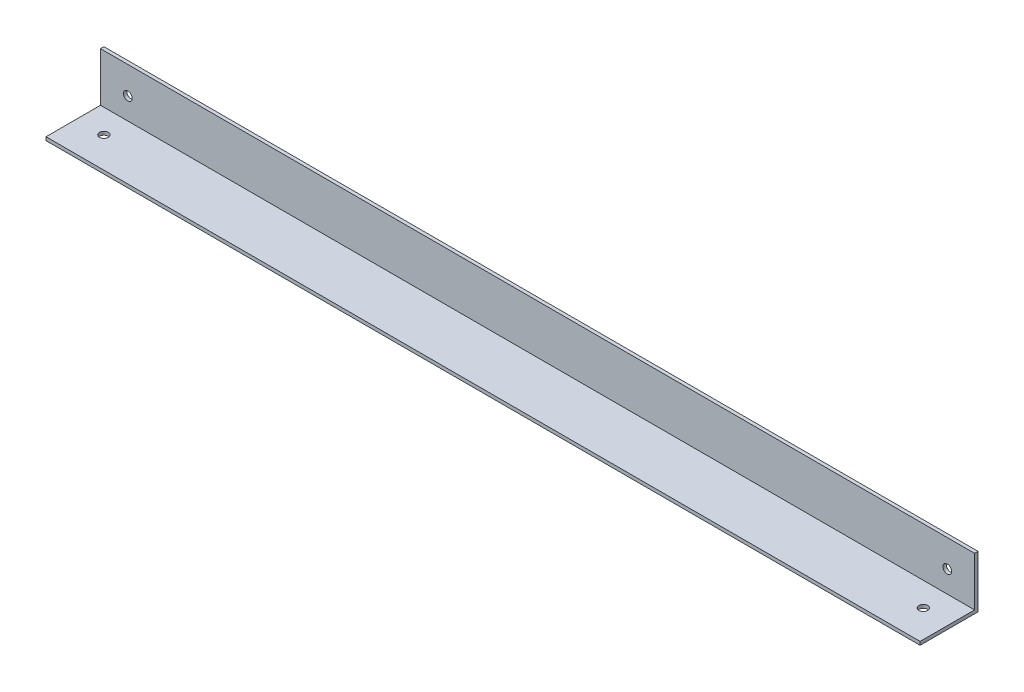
ISO-10303-21;
HEADER;
FILE_DESCRIPTION(('STEP AP214'),'2;1');
FILE_NAME('part.step','',(''),(''),'','','');
FILE_SCHEMA(('AUTOMOTIVE_DESIGN { 1 0 10303 214 1 1 1 1 }'));
ENDSEC;
DATA;
#1=APPLICATION_CONTEXT('core data for automotive mechanical design processes');
#2=APPLICATION_PROTOCOL_DEFINITION('international standard','automotive_design',2000,#1);
#3=PRODUCT_CONTEXT('',#1,'mechanical');
#4=PRODUCT('Part','Part','',(#3));
#5=PRODUCT_RELATED_PRODUCT_CATEGORY('part','',(#4));
#6=PRODUCT_DEFINITION_FORMATION('','',#4);
#7=PRODUCT_DEFINITION_CONTEXT('part definition',#1,'design');
#8=PRODUCT_DEFINITION('design','',#6,#7);
#9=PRODUCT_DEFINITION_SHAPE('','',#8);
#10=(LENGTH_UNIT() NAMED_UNIT(*) SI_UNIT(.MILLI.,.METRE.));
#11=(NAMED_UNIT(*) PLANE_ANGLE_UNIT() SI_UNIT($,.RADIAN.));
#12=(NAMED_UNIT(*) SI_UNIT($,.STERADIAN.) SOLID_ANGLE_UNIT());
#13=UNCERTAINTY_MEASURE_WITH_UNIT(LENGTH_MEASURE(1.E-05),#10,'distance_accuracy_value','');
#14=(GEOMETRIC_REPRESENTATION_CONTEXT(3) GLOBAL_UNCERTAINTY_ASSIGNED_CONTEXT((#13)) GLOBAL_UNIT_ASSIGNED_CONTEXT((#10,
#11,#12)) REPRESENTATION_CONTEXT('',''));
#15=CARTESIAN_POINT('',(0.,0.,0.));
#16=DIRECTION('',(0.,0.,1.));
#17=DIRECTION('',(1.,0.,0.));
#18=AXIS2_PLACEMENT_3D('',#15,#16,#17);
#19=CARTESIAN_POINT('',(0.,0.,26.924));
#20=DIRECTION('',(0.,0.,1.));
#21=DIRECTION('',(1.,0.,0.));
#22=AXIS2_PLACEMENT_3D('',#19,#20,#21);
#23=PLANE('',#22);
#24=DIRECTION('',(1.,0.,0.));
#25=VECTOR('',#24,1.);
#26=CARTESIAN_POINT('',(-209.826086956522,45.0420093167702,26.924));
#27=LINE('',#26,#25);
#28=CARTESIAN_POINT('',(-209.826086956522,45.0420093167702,26.924));
#29=VERTEX_POINT('',#28);
#30=CARTESIAN_POINT('',(196.573913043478,45.0420093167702,26.924));
#31=VERTEX_POINT('',#30);
#32=EDGE_CURVE('E117',#29,#31,#27,.T.);
#33=ORIENTED_EDGE('',*,*,#32,.F.);
#34=DIRECTION('',(0.,-1.,0.));
#35=VECTOR('',#34,1.);
#36=CARTESIAN_POINT('',(-209.826086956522,67.8385093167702,26.924));
#37=LINE('',#36,#35);
#38=CARTESIAN_POINT('',(-209.826086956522,43.4545093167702,26.924));
#39=VERTEX_POINT('',#38);
#40=EDGE_CURVE('E95',#29,#39,#37,.T.);
#41=ORIENTED_EDGE('',*,*,#40,.T.);
#42=DIRECTION('',(1.,0.,0.));
#43=VECTOR('',#42,1.);
#44=CARTESIAN_POINT('',(-209.826086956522,43.4545093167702,26.924));
#45=LINE('',#44,#43);
#46=CARTESIAN_POINT('',(196.573913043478,43.4545093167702,26.924));
#47=VERTEX_POINT('',#46);
#48=EDGE_CURVE('E57',#39,#47,#45,.T.);
#49=ORIENTED_EDGE('',*,*,#48,.T.);
#50=DIRECTION('',(0.,1.,0.));
#51=VECTOR('',#50,1.);
#52=CARTESIAN_POINT('',(196.573913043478,67.8385093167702,26.924));
#53=LINE('',#52,#51);
#54=EDGE_CURVE('E88',#47,#31,#53,.T.);
#55=ORIENTED_EDGE('',*,*,#54,.T.);
#56=EDGE_LOOP('',(#33,#41,#49,#55));
#57=FACE_BOUND('',#56,.T.);
#58=ADVANCED_FACE('F38',(#57),#23,.T.);
#59=CARTESIAN_POINT('',(-209.826086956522,67.8385093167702,26.924));
#60=DIRECTION('',(1.,0.,0.));
#61=DIRECTION('',(0.,0.,-1.));
#62=AXIS2_PLACEMENT_3D('',#59,#60,#61);
#63=PLANE('',#62);
#64=DIRECTION('',(0.,0.,1.));
#65=VECTOR('',#64,1.);
#66=CARTESIAN_POINT('',(-209.826086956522,45.0420093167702,-404.93789811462));
#67=LINE('',#66,#65);
#68=CARTESIAN_POINT('',(-209.826086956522,45.0420093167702,1.58750000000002));
#69=VERTEX_POINT('',#68);
#70=EDGE_CURVE('E145',#69,#29,#67,.T.);
#71=ORIENTED_EDGE('',*,*,#70,.F.);
#72=DIRECTION('',(0.,1.,0.));
#73=VECTOR('',#72,1.);
#74=CARTESIAN_POINT('',(-209.826086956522,55.1385093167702,1.5875));
#75=LINE('',#74,#73);
#76=CARTESIAN_POINT('',(-209.826086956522,67.8385093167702,1.5875));
#77=VERTEX_POINT('',#76);
#78=EDGE_CURVE('E87',#69,#77,#75,.T.);
#79=ORIENTED_EDGE('',*,*,#78,.T.);
#80=DIRECTION('',(0.,0.,-1.));
#81=VECTOR('',#80,1.);
#82=CARTESIAN_POINT('',(-209.826086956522,67.8385093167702,26.924));
#83=LINE('',#82,#81);
#84=CARTESIAN_POINT('',(-209.826086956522,67.8385093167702,0.));
#85=VERTEX_POINT('',#84);
#86=EDGE_CURVE('E81',#77,#85,#83,.T.);
#87=ORIENTED_EDGE('',*,*,#86,.T.);
#88=DIRECTION('',(0.,-1.,0.));
#89=VECTOR('',#88,1.);
#90=CARTESIAN_POINT('',(-209.826086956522,67.8385093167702,0.));
#91=LINE('',#90,#89);
#92=CARTESIAN_POINT('',(-209.826086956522,43.4545093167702,0.));
#93=VERTEX_POINT('',#92);
#94=EDGE_CURVE('E85',#85,#93,#91,.T.);
#95=ORIENTED_EDGE('',*,*,#94,.T.);
#96=DIRECTION('',(0.,0.,-1.));
#97=VECTOR('',#96,1.);
#98=CARTESIAN_POINT('',(-209.826086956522,43.4545093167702,26.924));
#99=LINE('',#98,#97);
#100=EDGE_CURVE('E11',#39,#93,#99,.T.);
#101=ORIENTED_EDGE('',*,*,#100,.F.);
#102=ORIENTED_EDGE('',*,*,#40,.F.);
#103=EDGE_LOOP('',(#71,#79,#87,#95,#101,#102));
#104=FACE_BOUND('',#103,.T.);
#105=ADVANCED_FACE('F40',(#104),#63,.F.);
#106=CARTESIAN_POINT('',(-209.826086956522,43.4545093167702,26.924));
#107=DIRECTION('',(0.,1.,0.));
#108=DIRECTION('',(0.,0.,1.));
#109=AXIS2_PLACEMENT_3D('',#106,#107,#108);
#110=PLANE('',#109);
#111=CARTESIAN_POINT('',(-197.126086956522,43.4545093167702,12.7));
#112=DIRECTION('',(0.,-1.,0.));
#113=DIRECTION('',(0.,0.,-1.));
#114=AXIS2_PLACEMENT_3D('',#111,#112,#113);
#115=CIRCLE('',#114,2.03200000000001);
#116=CARTESIAN_POINT('',(-197.126086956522,43.4545093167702,10.668));
#117=VERTEX_POINT('',#116);
#118=EDGE_CURVE('E115',#117,#117,#115,.T.);
#119=ORIENTED_EDGE('',*,*,#118,.F.);
#120=EDGE_LOOP('',(#119));
#121=FACE_BOUND('',#120,.T.);
#122=CARTESIAN_POINT('',(183.873913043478,43.4545093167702,12.7));
#123=DIRECTION('',(0.,-1.,0.));
#124=DIRECTION('',(0.,0.,1.));
#125=AXIS2_PLACEMENT_3D('',#122,#123,#124);
#126=CIRCLE('',#125,2.03200000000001);
#127=CARTESIAN_POINT('',(183.873913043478,43.4545093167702,14.732));
#128=VERTEX_POINT('',#127);
#129=EDGE_CURVE('E124',#128,#128,#126,.T.);
#130=ORIENTED_EDGE('',*,*,#129,.F.);
#131=EDGE_LOOP('',(#130));
#132=FACE_BOUND('',#131,.T.);
#133=DIRECTION('',(1.,0.,0.));
#134=VECTOR('',#133,1.);
#135=CARTESIAN_POINT('',(-209.826086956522,43.4545093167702,0.));
#136=LINE('',#135,#134);
#137=CARTESIAN_POINT('',(196.573913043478,43.4545093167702,0.));
#138=VERTEX_POINT('',#137);
#139=EDGE_CURVE('E99',#93,#138,#136,.T.);
#140=ORIENTED_EDGE('',*,*,#139,.T.);
#141=DIRECTION('',(0.,0.,-1.));
#142=VECTOR('',#141,1.);
#143=CARTESIAN_POINT('',(196.573913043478,43.4545093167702,26.924));
#144=LINE('',#143,#142);
#145=EDGE_CURVE('E48',#47,#138,#144,.T.);
#146=ORIENTED_EDGE('',*,*,#145,.F.);
#147=ORIENTED_EDGE('',*,*,#48,.F.);
#148=ORIENTED_EDGE('',*,*,#100,.T.);
#149=EDGE_LOOP('',(#140,#146,#147,#148));
#150=FACE_BOUND('',#149,.T.);
#151=ADVANCED_FACE('F176',(#121,#132,#150),#110,.F.);
#152=CARTESIAN_POINT('',(196.573913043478,67.8385093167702,26.924));
#153=DIRECTION('',(-1.,0.,0.));
#154=DIRECTION('',(0.,0.,1.));
#155=AXIS2_PLACEMENT_3D('',#152,#153,#154);
#156=PLANE('',#155);
#157=DIRECTION('',(0.,1.,0.));
#158=VECTOR('',#157,1.);
#159=CARTESIAN_POINT('',(196.573913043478,55.1385093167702,1.5875));
#160=LINE('',#159,#158);
#161=CARTESIAN_POINT('',(196.573913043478,45.0420093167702,1.58750000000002));
#162=VERTEX_POINT('',#161);
#163=CARTESIAN_POINT('',(196.573913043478,67.8385093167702,1.5875));
#164=VERTEX_POINT('',#163);
#165=EDGE_CURVE('E102',#162,#164,#160,.T.);
#166=ORIENTED_EDGE('',*,*,#165,.F.);
#167=DIRECTION('',(0.,0.,1.));
#168=VECTOR('',#167,1.);
#169=CARTESIAN_POINT('',(196.573913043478,45.0420093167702,-404.93789811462));
#170=LINE('',#169,#168);
#171=EDGE_CURVE('E142',#162,#31,#170,.T.);
#172=ORIENTED_EDGE('',*,*,#171,.T.);
#173=ORIENTED_EDGE('',*,*,#54,.F.);
#174=ORIENTED_EDGE('',*,*,#145,.T.);
#175=DIRECTION('',(0.,1.,0.));
#176=VECTOR('',#175,1.);
#177=CARTESIAN_POINT('',(196.573913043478,67.8385093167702,0.));
#178=LINE('',#177,#176);
#179=CARTESIAN_POINT('',(196.573913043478,67.8385093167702,0.));
#180=VERTEX_POINT('',#179);
#181=EDGE_CURVE('E96',#138,#180,#178,.T.);
#182=ORIENTED_EDGE('',*,*,#181,.T.);
#183=DIRECTION('',(0.,0.,-1.));
#184=VECTOR('',#183,1.);
#185=CARTESIAN_POINT('',(196.573913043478,67.8385093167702,26.924));
#186=LINE('',#185,#184);
#187=EDGE_CURVE('E74',#164,#180,#186,.T.);
#188=ORIENTED_EDGE('',*,*,#187,.F.);
#189=EDGE_LOOP('',(#166,#172,#173,#174,#182,#188));
#190=FACE_BOUND('',#189,.T.);
#191=ADVANCED_FACE('F162',(#190),#156,.F.);
#192=CARTESIAN_POINT('',(-209.826086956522,67.8385093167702,26.924));
#193=DIRECTION('',(0.,-1.,0.));
#194=DIRECTION('',(0.,0.,-1.));
#195=AXIS2_PLACEMENT_3D('',#192,#193,#194);
#196=PLANE('',#195);
#197=ORIENTED_EDGE('',*,*,#86,.F.);
#198=DIRECTION('',(-1.,0.,0.));
#199=VECTOR('',#198,1.);
#200=CARTESIAN_POINT('',(-209.826086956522,67.8385093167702,1.5875));
#201=LINE('',#200,#199);
#202=EDGE_CURVE('E148',#164,#77,#201,.T.);
#203=ORIENTED_EDGE('',*,*,#202,.F.);
#204=ORIENTED_EDGE('',*,*,#187,.T.);
#205=DIRECTION('',(-1.,0.,0.));
#206=VECTOR('',#205,1.);
#207=CARTESIAN_POINT('',(-209.826086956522,67.8385093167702,0.));
#208=LINE('',#207,#206);
#209=EDGE_CURVE('E91',#180,#85,#208,.T.);
#210=ORIENTED_EDGE('',*,*,#209,.T.);
#211=EDGE_LOOP('',(#197,#203,#204,#210));
#212=FACE_BOUND('',#211,.T.);
#213=ADVANCED_FACE('F92',(#212),#196,.F.);
#214=CARTESIAN_POINT('',(0.,0.,0.));
#215=DIRECTION('',(0.,0.,1.));
#216=DIRECTION('',(1.,0.,0.));
#217=AXIS2_PLACEMENT_3D('',#214,#215,#216);
#218=PLANE('',#217);
#219=CARTESIAN_POINT('',(183.873913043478,55.1385093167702,0.));
#220=DIRECTION('',(0.,0.,-1.));
#221=DIRECTION('',(-1.,0.,0.));
#222=AXIS2_PLACEMENT_3D('',#219,#220,#221);
#223=CIRCLE('',#222,2.03200000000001);
#224=CARTESIAN_POINT('',(181.841913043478,55.1385093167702,0.));
#225=VERTEX_POINT('',#224);
#226=EDGE_CURVE('E120',#225,#225,#223,.T.);
#227=ORIENTED_EDGE('',*,*,#226,.F.);
#228=EDGE_LOOP('',(#227));
#229=FACE_BOUND('',#228,.T.);
#230=CARTESIAN_POINT('',(-197.126086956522,55.1385093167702,0.));
#231=DIRECTION('',(0.,0.,-1.));
#232=DIRECTION('',(1.,0.,0.));
#233=AXIS2_PLACEMENT_3D('',#230,#231,#232);
#234=CIRCLE('',#233,2.03200000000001);
#235=CARTESIAN_POINT('',(-195.094086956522,55.1385093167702,0.));
#236=VERTEX_POINT('',#235);
#237=EDGE_CURVE('E126',#236,#236,#234,.T.);
#238=ORIENTED_EDGE('',*,*,#237,.F.);
#239=EDGE_LOOP('',(#238));
#240=FACE_BOUND('',#239,.T.);
#241=ORIENTED_EDGE('',*,*,#94,.F.);
#242=ORIENTED_EDGE('',*,*,#209,.F.);
#243=ORIENTED_EDGE('',*,*,#181,.F.);
#244=ORIENTED_EDGE('',*,*,#139,.F.);
#245=EDGE_LOOP('',(#241,#242,#243,#244));
#246=FACE_BOUND('',#245,.T.);
#247=ADVANCED_FACE('F98',(#229,#240,#246),#218,.F.);
#248=CARTESIAN_POINT('',(-209.826086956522,55.1385093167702,1.5875));
#249=DIRECTION('',(0.,0.,-1.));
#250=DIRECTION('',(-1.,0.,0.));
#251=AXIS2_PLACEMENT_3D('',#248,#249,#250);
#252=PLANE('',#251);
#253=CARTESIAN_POINT('',(183.873913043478,55.1385093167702,1.5875));
#254=DIRECTION('',(0.,0.,-1.));
#255=DIRECTION('',(-1.,0.,0.));
#256=AXIS2_PLACEMENT_3D('',#253,#254,#255);
#257=CIRCLE('',#256,2.03200000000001);
#258=CARTESIAN_POINT('',(181.841913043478,55.1385093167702,1.5875));
#259=VERTEX_POINT('',#258);
#260=EDGE_CURVE('E42',#259,#259,#257,.T.);
#261=ORIENTED_EDGE('',*,*,#260,.T.);
#262=EDGE_LOOP('',(#261));
#263=FACE_BOUND('',#262,.T.);
#264=CARTESIAN_POINT('',(-197.126086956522,55.1385093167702,1.5875));
#265=DIRECTION('',(0.,0.,-1.));
#266=DIRECTION('',(-1.,0.,0.));
#267=AXIS2_PLACEMENT_3D('',#264,#265,#266);
#268=CIRCLE('',#267,2.03200000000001);
#269=CARTESIAN_POINT('',(-199.158086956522,55.1385093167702,1.5875));
#270=VERTEX_POINT('',#269);
#271=EDGE_CURVE('E118',#270,#270,#268,.T.);
#272=ORIENTED_EDGE('',*,*,#271,.T.);
#273=EDGE_LOOP('',(#272));
#274=FACE_BOUND('',#273,.T.);
#275=ORIENTED_EDGE('',*,*,#202,.T.);
#276=ORIENTED_EDGE('',*,*,#78,.F.);
#277=DIRECTION('',(1.,0.,0.));
#278=VECTOR('',#277,1.);
#279=CARTESIAN_POINT('',(-209.826086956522,45.0420093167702,1.58750000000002));
#280=LINE('',#279,#278);
#281=EDGE_CURVE('E139',#69,#162,#280,.T.);
#282=ORIENTED_EDGE('',*,*,#281,.T.);
#283=ORIENTED_EDGE('',*,*,#165,.T.);
#284=EDGE_LOOP('',(#275,#276,#282,#283));
#285=FACE_BOUND('',#284,.T.);
#286=ADVANCED_FACE('F170',(#263,#274,#285),#252,.F.);
#287=CARTESIAN_POINT('',(-209.826086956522,45.0420093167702,-404.93789811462));
#288=DIRECTION('',(0.,-1.,0.));
#289=DIRECTION('',(0.,0.,-1.));
#290=AXIS2_PLACEMENT_3D('',#287,#288,#289);
#291=PLANE('',#290);
#292=CARTESIAN_POINT('',(-197.126086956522,45.0420093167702,12.7));
#293=DIRECTION('',(0.,-1.,0.));
#294=DIRECTION('',(0.,0.,-1.));
#295=AXIS2_PLACEMENT_3D('',#292,#293,#294);
#296=CIRCLE('',#295,2.03200000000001);
#297=CARTESIAN_POINT('',(-197.126086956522,45.0420093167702,10.668));
#298=VERTEX_POINT('',#297);
#299=EDGE_CURVE('E114',#298,#298,#296,.T.);
#300=ORIENTED_EDGE('',*,*,#299,.T.);
#301=EDGE_LOOP('',(#300));
#302=FACE_BOUND('',#301,.T.);
#303=CARTESIAN_POINT('',(183.873913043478,45.0420093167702,12.7));
#304=DIRECTION('',(0.,-1.,0.));
#305=DIRECTION('',(0.,0.,-1.));
#306=AXIS2_PLACEMENT_3D('',#303,#304,#305);
#307=CIRCLE('',#306,2.03200000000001);
#308=CARTESIAN_POINT('',(183.873913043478,45.0420093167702,10.668));
#309=VERTEX_POINT('',#308);
#310=EDGE_CURVE('E111',#309,#309,#307,.T.);
#311=ORIENTED_EDGE('',*,*,#310,.T.);
#312=EDGE_LOOP('',(#311));
#313=FACE_BOUND('',#312,.T.);
#314=ORIENTED_EDGE('',*,*,#70,.T.);
#315=ORIENTED_EDGE('',*,*,#32,.T.);
#316=ORIENTED_EDGE('',*,*,#171,.F.);
#317=ORIENTED_EDGE('',*,*,#281,.F.);
#318=EDGE_LOOP('',(#314,#315,#316,#317));
#319=FACE_BOUND('',#318,.T.);
#320=ADVANCED_FACE('F167',(#302,#313,#319),#291,.F.);
#321=CARTESIAN_POINT('',(183.873913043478,45.9945093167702,12.7));
#322=DIRECTION('',(0.,-1.,0.));
#323=DIRECTION('',(0.,0.,-1.));
#324=AXIS2_PLACEMENT_3D('',#321,#322,#323);
#325=CYLINDRICAL_SURFACE('',#324,2.03200000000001);
#326=ORIENTED_EDGE('',*,*,#129,.T.);
#327=EDGE_LOOP('',(#326));
#328=FACE_BOUND('',#327,.T.);
#329=ORIENTED_EDGE('',*,*,#310,.F.);
#330=EDGE_LOOP('',(#329));
#331=FACE_BOUND('',#330,.T.);
#332=ADVANCED_FACE('F219',(#328,#331),#325,.F.);
#333=CARTESIAN_POINT('',(-197.126086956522,45.9945093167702,12.7));
#334=DIRECTION('',(0.,-1.,0.));
#335=DIRECTION('',(0.,0.,-1.));
#336=AXIS2_PLACEMENT_3D('',#333,#334,#335);
#337=CYLINDRICAL_SURFACE('',#336,2.03200000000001);
#338=ORIENTED_EDGE('',*,*,#118,.T.);
#339=EDGE_LOOP('',(#338));
#340=FACE_BOUND('',#339,.T.);
#341=ORIENTED_EDGE('',*,*,#299,.F.);
#342=EDGE_LOOP('',(#341));
#343=FACE_BOUND('',#342,.T.);
#344=ADVANCED_FACE('F226',(#340,#343),#337,.F.);
#345=CARTESIAN_POINT('',(-197.126086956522,55.1385093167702,2.54));
#346=DIRECTION('',(0.,0.,-1.));
#347=DIRECTION('',(-1.,0.,0.));
#348=AXIS2_PLACEMENT_3D('',#345,#346,#347);
#349=CYLINDRICAL_SURFACE('',#348,2.03200000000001);
#350=ORIENTED_EDGE('',*,*,#237,.T.);
#351=EDGE_LOOP('',(#350));
#352=FACE_BOUND('',#351,.T.);
#353=ORIENTED_EDGE('',*,*,#271,.F.);
#354=EDGE_LOOP('',(#353));
#355=FACE_BOUND('',#354,.T.);
#356=ADVANCED_FACE('F233',(#352,#355),#349,.F.);
#357=CARTESIAN_POINT('',(183.873913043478,55.1385093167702,2.54));
#358=DIRECTION('',(0.,0.,-1.));
#359=DIRECTION('',(-1.,0.,0.));
#360=AXIS2_PLACEMENT_3D('',#357,#358,#359);
#361=CYLINDRICAL_SURFACE('',#360,2.03200000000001);
#362=ORIENTED_EDGE('',*,*,#226,.T.);
#363=EDGE_LOOP('',(#362));
#364=FACE_BOUND('',#363,.T.);
#365=ORIENTED_EDGE('',*,*,#260,.F.);
#366=EDGE_LOOP('',(#365));
#367=FACE_BOUND('',#366,.T.);
#368=ADVANCED_FACE('F240',(#364,#367),#361,.F.);
#369=CLOSED_SHELL('',(#58,#105,#151,#191,#213,#247,#286,#320,#332,#344,#356,#368));
#370=MANIFOLD_SOLID_BREP('B2',#369);
#371=ADVANCED_BREP_SHAPE_REPRESENTATION('',(#18,#370),#14);
#372=SHAPE_DEFINITION_REPRESENTATION(#9,#371);
ENDSEC;
END-ISO-10303-21;
